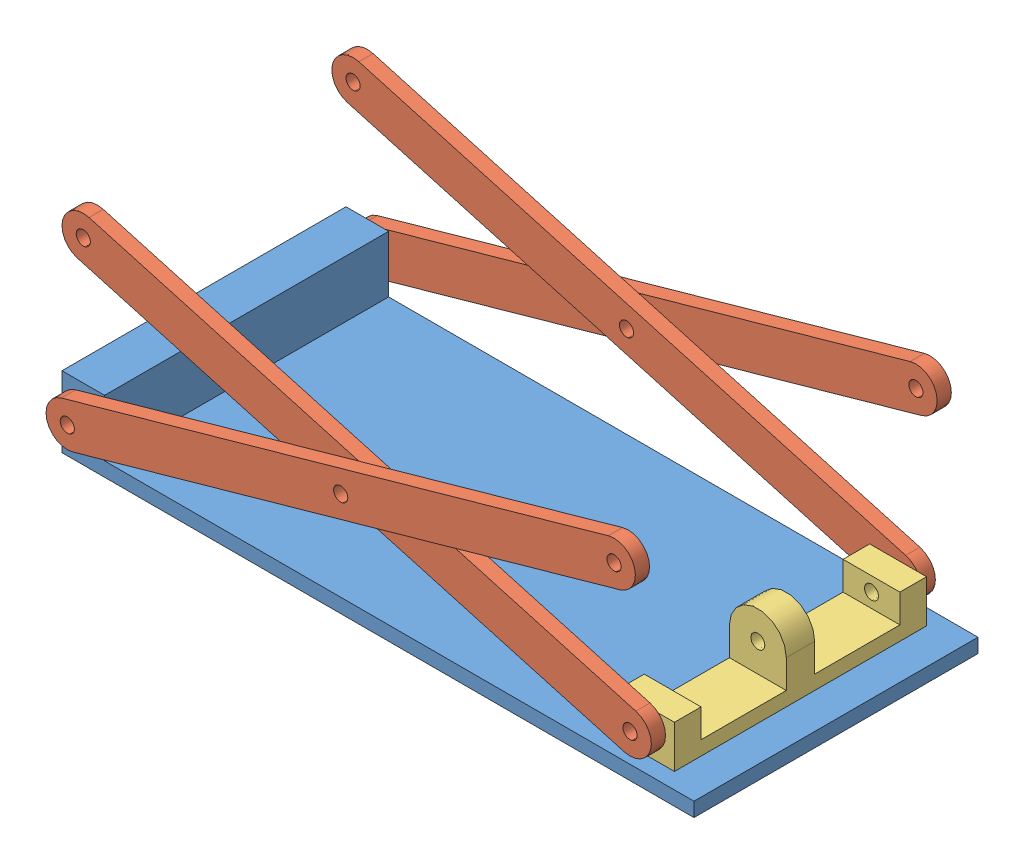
SolidWorks assembly lift.SLDASM, configuration collapsed (file format 14000). Lengths in mm.
Overall size (569.6 199.41 282.58).
6 component instances, 3 part files, 14 mates.
Components (placement in the parent):
- base-1: base.SLDPRT [Default] at origin
- link-1: link.SLDPRT [Default] at (24.2179 19.7644 255.5875) x (0.9625 0.271282 0) z (0 0 1)
- link-2: link.SLDPRT [Default] at (24.2179 19.7644 -14.2875) x (0.9625 0.271282 0) z (0 0 1)
- slider-1: slider.SLDPRT [Default] at (482.6 12.7 14.2875)
- link-3: link.SLDPRT [Default] at (13.8821 157.5755 0) x (0.9625 -0.271282 0) z (0 0 1)
- link-4: link.SLDPRT [Default] at (13.8821 157.5755 241.3) x (0.9625 -0.271282 0) z (0 0 1)
Mates (geometry in assembly coordinates):
- Concentric1: concentric aligned: cylinder of link-1 through (263.525 107.0055 255.5875) axis (0 0 1) radius 6.35; cylinder of link-4 through (263.525 107.0055 241.3) axis (0 0 1) radius 6.35
- Concentric2: concentric aligned: cylinder of link-2 through (263.525 107.0055 -14.2875) axis (0 0 1) radius 6.35; cylinder of link-3 through (263.525 107.0055 0) axis (0 0 1) radius 6.35
- Distance19: distance = 1.5875 mm anti-aligned: plane of link-2 through (19.05 38.1 -1.5875) normal (0 0 1); plane of link-3 through (19.05 175.9111 0) normal (0 0 -1)
- Distance20: distance = 1.5875 mm anti-aligned: plane of link-1 through (19.05 38.1 255.5875) normal (0 0 -1); plane of link-4 through (19.05 175.9111 254) normal (0 0 1)
- Concentric3: concentric aligned: cylinder of base-1 through (19.05 38.1 0) axis (0 0 1) radius 6.35; cylinder of link-1 through (19.05 38.1 255.5875) axis (0 0 1) radius 6.35
- Distance21: distance = 1.5875 mm anti-aligned: plane of base-1 through (0 12.7 254) normal (0 0 1); plane of link-1 through (19.05 38.1 255.5875) normal (0 0 -1)
- Concentric4: concentric aligned: cylinder of base-1 through (19.05 38.1 0) axis (0 0 1) radius 6.35; cylinder of link-2 through (19.05 38.1 -14.2875) axis (0 0 1) radius 6.35
- Distance22: distance = 1.5875 mm anti-aligned: plane of base-1 through (0 12.7 0) normal (0 0 -1); plane of link-2 through (19.05 38.1 -1.5875) normal (0 0 1)
- Concentric5: concentric aligned: cylinder of slider-1 through (508 38.1 14.2875) axis (0 0 1) radius 6.35; cylinder of link-3 through (508 38.1 0) axis (0 0 1) radius 6.35
- Distance23: distance = 1.5875 mm anti-aligned: plane of slider-1 through (482.6 50.8 14.2875) normal (0 0 -1); plane of link-3 through (19.05 175.9111 12.7) normal (0 0 1)
- Concentric7: concentric aligned: cylinder of slider-1 through (508 38.1 14.2875) axis (0 0 1) radius 6.35; cylinder of link-4 through (508 38.1 241.3) axis (0 0 1) radius 6.35
- Coincident23: coincident anti-aligned: plane of base-1 through (0 12.7 254) normal (0 1 0); plane of slider-1 through (482.6 12.7 239.7125) normal (0 -1 0)
- Distance27: distance = 50.8 mm anti-aligned: plane of base-1 through (38.1 63.5 254) normal (1 0 0); plane of slider-1 through (482.6 12.7 239.7125) normal (-1 0 0)
- Distance28: distance = 444.5 mm anti-aligned: plane of base-1 through (38.1 63.5 254) normal (1 0 0); plane of slider-1 through (482.6 12.7 239.7125) normal (-1 0 0)
